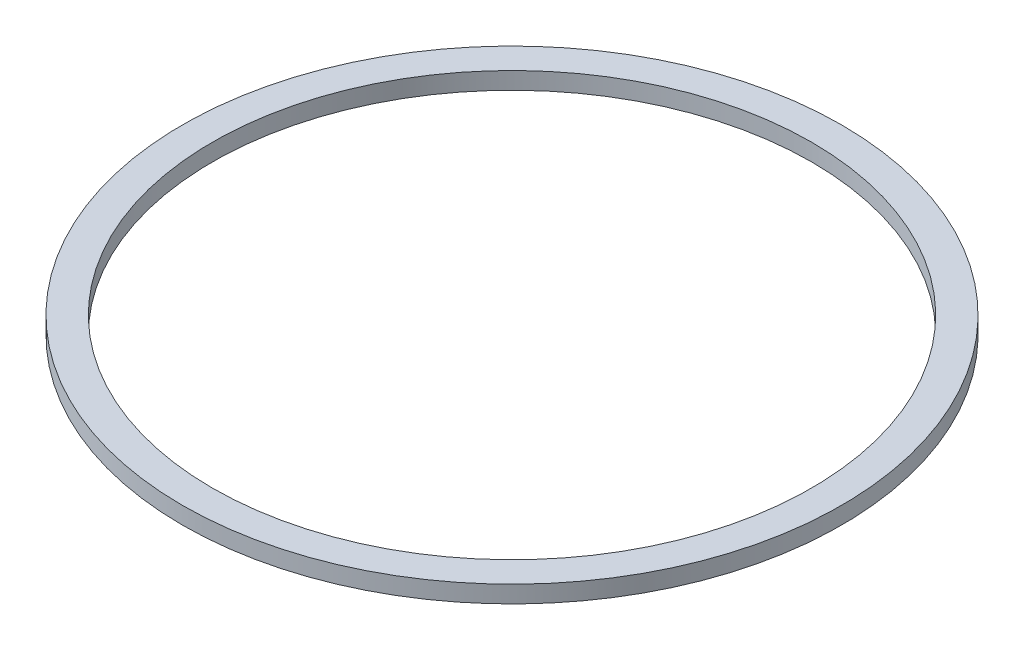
from build123d import *

# Parameters (mm, degrees)
SKETCH_1_R      = 19.25
SKETCH_1_R_2    = 17.5
EXTRUDE_1_DEPTH = 1


with BuildPart() as part:
    # Sketch 1 → Extrude 1 (new body)
    with BuildSketch(Plane(origin=(0, 0, 0), x_dir=(1, 0, 0), z_dir=(0, 1, 0))):
        with Locations(Location((0, 0, 0), (0, 0, 270))):
            Circle(SKETCH_1_R)
        with Locations(Location((0, 0, 0), (0, 0, 270))):
            Circle(SKETCH_1_R_2, mode=Mode.SUBTRACT)
    extrude(amount=EXTRUDE_1_DEPTH)


solid = part.part
